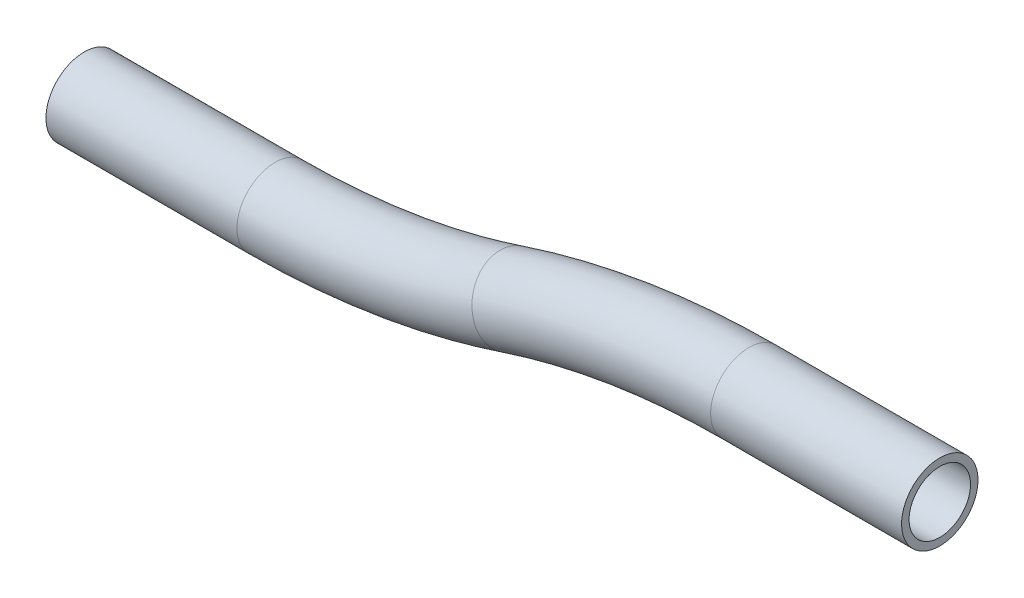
ISO-10303-21;
HEADER;
FILE_DESCRIPTION(('STEP AP214'),'2;1');
FILE_NAME('part.step','',(''),(''),'','','');
FILE_SCHEMA(('AUTOMOTIVE_DESIGN { 1 0 10303 214 1 1 1 1 }'));
ENDSEC;
DATA;
#1=APPLICATION_CONTEXT('core data for automotive mechanical design processes');
#2=APPLICATION_PROTOCOL_DEFINITION('international standard','automotive_design',2000,#1);
#3=PRODUCT_CONTEXT('',#1,'mechanical');
#4=PRODUCT('Part','Part','',(#3));
#5=PRODUCT_RELATED_PRODUCT_CATEGORY('part','',(#4));
#6=PRODUCT_DEFINITION_FORMATION('','',#4);
#7=PRODUCT_DEFINITION_CONTEXT('part definition',#1,'design');
#8=PRODUCT_DEFINITION('design','',#6,#7);
#9=PRODUCT_DEFINITION_SHAPE('','',#8);
#10=(LENGTH_UNIT() NAMED_UNIT(*) SI_UNIT(.MILLI.,.METRE.));
#11=(NAMED_UNIT(*) PLANE_ANGLE_UNIT() SI_UNIT($,.RADIAN.));
#12=(NAMED_UNIT(*) SI_UNIT($,.STERADIAN.) SOLID_ANGLE_UNIT());
#13=UNCERTAINTY_MEASURE_WITH_UNIT(LENGTH_MEASURE(1.E-05),#10,'distance_accuracy_value','');
#14=(GEOMETRIC_REPRESENTATION_CONTEXT(3) GLOBAL_UNCERTAINTY_ASSIGNED_CONTEXT((#13)) GLOBAL_UNIT_ASSIGNED_CONTEXT((#10,
#11,#12)) REPRESENTATION_CONTEXT('',''));
#15=CARTESIAN_POINT('',(0.,0.,0.));
#16=DIRECTION('',(0.,0.,1.));
#17=DIRECTION('',(1.,0.,0.));
#18=AXIS2_PLACEMENT_3D('',#15,#16,#17);
#19=CARTESIAN_POINT('',(110.49,12.7,0.));
#20=DIRECTION('',(1.,0.,0.));
#21=DIRECTION('',(0.,1.,0.));
#22=AXIS2_PLACEMENT_3D('',#19,#20,#21);
#23=CYLINDRICAL_SURFACE('',#22,6.35);
#24=CARTESIAN_POINT('',(110.49,12.7,0.));
#25=DIRECTION('',(1.,0.,0.));
#26=DIRECTION('',(0.,0.,-1.));
#27=AXIS2_PLACEMENT_3D('',#24,#25,#26);
#28=CIRCLE('',#27,6.35);
#29=CARTESIAN_POINT('',(110.49,19.05,0.));
#30=VERTEX_POINT('',#29);
#31=EDGE_CURVE('E39',#30,#30,#28,.T.);
#32=ORIENTED_EDGE('',*,*,#31,.T.);
#33=EDGE_LOOP('',(#32));
#34=FACE_BOUND('',#33,.T.);
#35=CARTESIAN_POINT('',(142.24,12.7,0.));
#36=DIRECTION('',(1.,0.,0.));
#37=DIRECTION('',(0.,0.,-1.));
#38=AXIS2_PLACEMENT_3D('',#35,#36,#37);
#39=CIRCLE('',#38,6.35);
#40=CARTESIAN_POINT('',(142.24,12.7,-6.35));
#41=VERTEX_POINT('',#40);
#42=EDGE_CURVE('E10',#41,#41,#39,.T.);
#43=ORIENTED_EDGE('',*,*,#42,.F.);
#44=EDGE_LOOP('',(#43));
#45=FACE_BOUND('',#44,.T.);
#46=ADVANCED_FACE('F29',(#34,#45),#23,.T.);
#47=CARTESIAN_POINT('',(110.49,12.7,0.));
#48=DIRECTION('',(1.,0.,0.));
#49=DIRECTION('',(0.,1.,0.));
#50=AXIS2_PLACEMENT_3D('',#47,#48,#49);
#51=CYLINDRICAL_SURFACE('',#50,5.1054);
#52=CARTESIAN_POINT('',(110.49,12.7,0.));
#53=DIRECTION('',(1.,0.,0.));
#54=DIRECTION('',(0.,0.,-1.));
#55=AXIS2_PLACEMENT_3D('',#52,#53,#54);
#56=CIRCLE('',#55,5.1054);
#57=CARTESIAN_POINT('',(110.49,17.8054,0.));
#58=VERTEX_POINT('',#57);
#59=EDGE_CURVE('E43',#58,#58,#56,.T.);
#60=ORIENTED_EDGE('',*,*,#59,.F.);
#61=EDGE_LOOP('',(#60));
#62=FACE_BOUND('',#61,.T.);
#63=CARTESIAN_POINT('',(142.24,12.7,0.));
#64=DIRECTION('',(1.,0.,0.));
#65=DIRECTION('',(0.,0.,-1.));
#66=AXIS2_PLACEMENT_3D('',#63,#64,#65);
#67=CIRCLE('',#66,5.1054);
#68=CARTESIAN_POINT('',(142.24,12.7,-5.1054));
#69=VERTEX_POINT('',#68);
#70=EDGE_CURVE('E35',#69,#69,#67,.T.);
#71=ORIENTED_EDGE('',*,*,#70,.T.);
#72=EDGE_LOOP('',(#71));
#73=FACE_BOUND('',#72,.T.);
#74=ADVANCED_FACE('F84',(#62,#73),#51,.F.);
#75=CARTESIAN_POINT('',(110.49,-112.522,0.));
#76=DIRECTION('',(0.,0.,-1.));
#77=DIRECTION('',(-1.,0.,0.));
#78=AXIS2_PLACEMENT_3D('',#75,#76,#77);
#79=TOROIDAL_SURFACE('',#78,125.222,6.35);
#80=CARTESIAN_POINT('',(71.12,6.34999999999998,0.));
#81=DIRECTION('',(0.949290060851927,0.314401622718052,0.));
#82=DIRECTION('',(0.,0.,-1.));
#83=AXIS2_PLACEMENT_3D('',#80,#81,#82);
#84=CIRCLE('',#83,6.35);
#85=CARTESIAN_POINT('',(69.1235496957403,12.3779918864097,0.));
#86=VERTEX_POINT('',#85);
#87=EDGE_CURVE('E48',#86,#86,#84,.T.);
#88=CARTESIAN_POINT('',(110.49,-112.522,0.));
#89=DIRECTION('',(0.,0.,-1.));
#90=DIRECTION('',(-1.,0.,0.));
#91=AXIS2_PLACEMENT_3D('',#88,#89,#90);
#92=CIRCLE('',#91,131.572);
#93=EDGE_CURVE('',#86,#30,#92,.T.);
#94=ORIENTED_EDGE('',*,*,#87,.T.);
#95=ORIENTED_EDGE('',*,*,#31,.F.);
#96=ORIENTED_EDGE('',*,*,#93,.T.);
#97=ORIENTED_EDGE('',*,*,#93,.F.);
#98=EDGE_LOOP('',(#94,#96,#95,#97));
#99=FACE_BOUND('',#98,.T.);
#100=ADVANCED_FACE('F80',(#99),#79,.T.);
#101=CARTESIAN_POINT('',(110.49,-112.522,0.));
#102=DIRECTION('',(0.,0.,-1.));
#103=DIRECTION('',(-1.,0.,0.));
#104=AXIS2_PLACEMENT_3D('',#101,#102,#103);
#105=TOROIDAL_SURFACE('',#104,125.222,5.1054);
#106=CARTESIAN_POINT('',(71.12,6.34999999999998,0.));
#107=DIRECTION('',(0.949290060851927,0.314401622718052,0.));
#108=DIRECTION('',(0.,0.,-1.));
#109=AXIS2_PLACEMENT_3D('',#106,#107,#108);
#110=CIRCLE('',#109,5.1054);
#111=CARTESIAN_POINT('',(69.5148539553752,11.1965054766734,0.));
#112=VERTEX_POINT('',#111);
#113=EDGE_CURVE('E51',#112,#112,#110,.T.);
#114=CARTESIAN_POINT('',(110.49,-112.522,0.));
#115=DIRECTION('',(0.,0.,-1.));
#116=DIRECTION('',(-1.,0.,0.));
#117=AXIS2_PLACEMENT_3D('',#114,#115,#116);
#118=CIRCLE('',#117,130.3274);
#119=EDGE_CURVE('',#112,#58,#118,.T.);
#120=ORIENTED_EDGE('',*,*,#113,.F.);
#121=ORIENTED_EDGE('',*,*,#59,.T.);
#122=ORIENTED_EDGE('',*,*,#119,.T.);
#123=ORIENTED_EDGE('',*,*,#119,.F.);
#124=EDGE_LOOP('',(#120,#122,#121,#123));
#125=FACE_BOUND('',#124,.T.);
#126=ADVANCED_FACE('F77',(#125),#105,.F.);
#127=CARTESIAN_POINT('',(31.75,125.222,0.));
#128=DIRECTION('',(0.,0.,1.));
#129=DIRECTION('',(1.,0.,0.));
#130=AXIS2_PLACEMENT_3D('',#127,#128,#129);
#131=TOROIDAL_SURFACE('',#130,125.222,6.35);
#132=CARTESIAN_POINT('',(31.75,0.,0.));
#133=DIRECTION('',(1.,0.,0.));
#134=DIRECTION('',(0.,0.,-1.));
#135=AXIS2_PLACEMENT_3D('',#132,#133,#134);
#136=CIRCLE('',#135,6.35);
#137=CARTESIAN_POINT('',(31.75,0.,-6.35));
#138=VERTEX_POINT('',#137);
#139=EDGE_CURVE('E54',#138,#138,#136,.T.);
#140=ORIENTED_EDGE('',*,*,#139,.T.);
#141=EDGE_LOOP('',(#140));
#142=FACE_BOUND('',#141,.T.);
#143=ORIENTED_EDGE('',*,*,#87,.F.);
#144=EDGE_LOOP('',(#143));
#145=FACE_BOUND('',#144,.T.);
#146=ADVANCED_FACE('F73',(#142,#145),#131,.T.);
#147=CARTESIAN_POINT('',(31.75,125.222,0.));
#148=DIRECTION('',(0.,0.,1.));
#149=DIRECTION('',(1.,0.,0.));
#150=AXIS2_PLACEMENT_3D('',#147,#148,#149);
#151=TOROIDAL_SURFACE('',#150,125.222,5.1054);
#152=CARTESIAN_POINT('',(31.75,0.,0.));
#153=DIRECTION('',(1.,0.,0.));
#154=DIRECTION('',(0.,0.,-1.));
#155=AXIS2_PLACEMENT_3D('',#152,#153,#154);
#156=CIRCLE('',#155,5.1054);
#157=CARTESIAN_POINT('',(31.75,0.,-5.1054));
#158=VERTEX_POINT('',#157);
#159=EDGE_CURVE('E58',#158,#158,#156,.T.);
#160=ORIENTED_EDGE('',*,*,#159,.F.);
#161=EDGE_LOOP('',(#160));
#162=FACE_BOUND('',#161,.T.);
#163=ORIENTED_EDGE('',*,*,#113,.T.);
#164=EDGE_LOOP('',(#163));
#165=FACE_BOUND('',#164,.T.);
#166=ADVANCED_FACE('F70',(#162,#165),#151,.F.);
#167=CARTESIAN_POINT('',(31.75,0.,0.));
#168=DIRECTION('',(-1.,0.,0.));
#169=DIRECTION('',(0.,0.,1.));
#170=AXIS2_PLACEMENT_3D('',#167,#168,#169);
#171=CYLINDRICAL_SURFACE('',#170,5.1054);
#172=ORIENTED_EDGE('',*,*,#159,.T.);
#173=EDGE_LOOP('',(#172));
#174=FACE_BOUND('',#173,.T.);
#175=CARTESIAN_POINT('',(0.,0.,0.));
#176=DIRECTION('',(1.,0.,0.));
#177=DIRECTION('',(0.,0.,-1.));
#178=AXIS2_PLACEMENT_3D('',#175,#176,#177);
#179=CIRCLE('',#178,5.1054);
#180=CARTESIAN_POINT('',(0.,0.,-5.1054));
#181=VERTEX_POINT('',#180);
#182=EDGE_CURVE('E59',#181,#181,#179,.T.);
#183=ORIENTED_EDGE('',*,*,#182,.F.);
#184=EDGE_LOOP('',(#183));
#185=FACE_BOUND('',#184,.T.);
#186=ADVANCED_FACE('F67',(#174,#185),#171,.F.);
#187=CARTESIAN_POINT('',(31.75,0.,0.));
#188=DIRECTION('',(-1.,0.,0.));
#189=DIRECTION('',(0.,0.,1.));
#190=AXIS2_PLACEMENT_3D('',#187,#188,#189);
#191=CYLINDRICAL_SURFACE('',#190,6.35);
#192=ORIENTED_EDGE('',*,*,#139,.F.);
#193=EDGE_LOOP('',(#192));
#194=FACE_BOUND('',#193,.T.);
#195=CARTESIAN_POINT('',(0.,0.,0.));
#196=DIRECTION('',(1.,0.,0.));
#197=DIRECTION('',(0.,0.,-1.));
#198=AXIS2_PLACEMENT_3D('',#195,#196,#197);
#199=CIRCLE('',#198,6.35);
#200=CARTESIAN_POINT('',(0.,0.,-6.35));
#201=VERTEX_POINT('',#200);
#202=EDGE_CURVE('E55',#201,#201,#199,.T.);
#203=ORIENTED_EDGE('',*,*,#202,.T.);
#204=EDGE_LOOP('',(#203));
#205=FACE_BOUND('',#204,.T.);
#206=ADVANCED_FACE('F99',(#194,#205),#191,.T.);
#207=CARTESIAN_POINT('',(142.24,12.7,0.));
#208=DIRECTION('',(1.,0.,0.));
#209=DIRECTION('',(0.,0.,-1.));
#210=AXIS2_PLACEMENT_3D('',#207,#208,#209);
#211=PLANE('',#210);
#212=ORIENTED_EDGE('',*,*,#70,.F.);
#213=EDGE_LOOP('',(#212));
#214=FACE_BOUND('',#213,.T.);
#215=ORIENTED_EDGE('',*,*,#42,.T.);
#216=EDGE_LOOP('',(#215));
#217=FACE_BOUND('',#216,.T.);
#218=ADVANCED_FACE('F102',(#214,#217),#211,.T.);
#219=CARTESIAN_POINT('',(0.,0.,0.));
#220=DIRECTION('',(1.,0.,0.));
#221=DIRECTION('',(0.,0.,-1.));
#222=AXIS2_PLACEMENT_3D('',#219,#220,#221);
#223=PLANE('',#222);
#224=ORIENTED_EDGE('',*,*,#182,.T.);
#225=EDGE_LOOP('',(#224));
#226=FACE_BOUND('',#225,.T.);
#227=ORIENTED_EDGE('',*,*,#202,.F.);
#228=EDGE_LOOP('',(#227));
#229=FACE_BOUND('',#228,.T.);
#230=ADVANCED_FACE('F104',(#226,#229),#223,.F.);
#231=CLOSED_SHELL('',(#46,#74,#100,#126,#146,#166,#186,#206,#218,#230));
#232=MANIFOLD_SOLID_BREP('B2',#231);
#233=ADVANCED_BREP_SHAPE_REPRESENTATION('',(#18,#232),#14);
#234=SHAPE_DEFINITION_REPRESENTATION(#9,#233);
ENDSEC;
END-ISO-10303-21;
